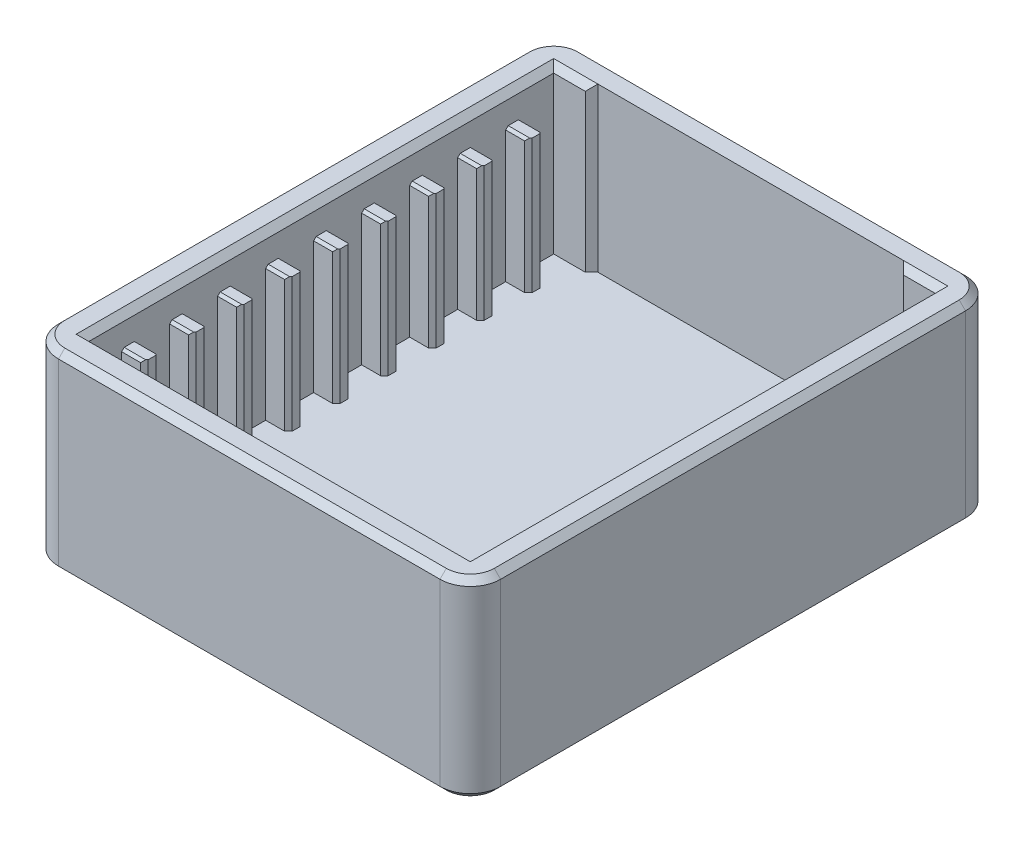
from build123d import *

# Parameters (mm, degrees)
BOSS_EXTRUDE1_DEPTH = 4.6
BOSS_EXTRUDE2_START = 4.6
BOSS_EXTRUDE2_DEPTH = 25.8
SKETCH1_5_W         = 3.6
SKETCH1_5_H         = 2.4
BOSS_EXTRUDE3_DEPTH = 25.8
CHAMFER1_SIZE       = 0.6
CHAMFER4_SIZE       = 0.4
CHAMFER6_SIZE       = 1
CUT_EXTRUDE2_DEPTH  = 25.8


with BuildPart() as part:
    # Sketch1 → Boss-Extrude1 (new body)
    with BuildSketch(Plane(origin=(0, 0, 0), x_dir=(1, 0, 0), z_dir=(0, 1, 0))):
        with BuildLine():
            Line((35, 78.4), (35, 83.2))
            Line((35, 83.2), (4.8, 83.2))
            ThreePointArc((4.8, 83.2), (1.40588745, 81.79411255), (0, 78.4))
            Line((0, 78.4), (0, 4.8))
            ThreePointArc((0, 4.8), (1.40588745, 1.40588745), (4.8, 0))
            Line((4.8, 0), (35, 0))
            Line((35, 0), (35, 4.8))
            Line((35, 4.8), (4.8, 4.8))
            Line((4.8, 4.8), (4.8, 10))
            Line((4.8, 10), (4.8, 12.4))
            Line((4.8, 12.4), (4.8, 17.6))
            Line((4.8, 17.6), (4.8, 20))
            Line((4.8, 20), (4.8, 25.2))
            Line((4.8, 25.2), (4.8, 27.6))
            Line((4.8, 27.6), (4.8, 32.8))
            Line((4.8, 32.8), (4.8, 35.2))
            Line((4.8, 35.2), (4.8, 40.4))
            Line((4.8, 40.4), (4.8, 42.8))
            Line((4.8, 42.8), (4.8, 48))
            Line((4.8, 48), (4.8, 50.4))
            Line((4.8, 50.4), (4.8, 55.6))
            Line((4.8, 55.6), (4.8, 58))
            Line((4.8, 58), (4.8, 63.2))
            Line((4.8, 63.2), (4.8, 65.6))
            Line((4.8, 65.6), (4.8, 70.8))
            Line((4.8, 70.8), (4.8, 73.2))
            Line((4.8, 73.2), (4.8, 78.4))
            Line((4.8, 78.4), (35, 78.4))
        make_face()
        Polygon((35, 4.8), (35, 78.4), (4.8, 78.4), (4.8, 73.2), (8.4, 73.2), (8.4, 70.8), (4.8, 70.8), (4.8, 65.6), (8.4, 65.6), (8.4, 63.2), (4.8, 63.2), (4.8, 58), (8.4, 58), (8.4, 55.6), (4.8, 55.6), (4.8, 50.4), (8.4, 50.4), (8.4, 48), (4.8, 48), (4.8, 42.8), (8.4, 42.8), (8.4, 40.4), (4.8, 40.4), (4.8, 35.2), (8.4, 35.2), (8.4, 32.8), (4.8, 32.8), (4.8, 27.6), (8.4, 27.6), (8.4, 25.2), (4.8, 25.2), (4.8, 20), (8.4, 20), (8.4, 17.6), (4.8, 17.6), (4.8, 12.4), (8.4, 12.4), (8.4, 10), (4.8, 10), (4.8, 4.8), align=None)
    extrude(amount=BOSS_EXTRUDE1_DEPTH)

    # Sketch1_3 → Boss-Extrude2 (add)
    with BuildSketch(Plane(origin=(0, 0, 0), x_dir=(1, 0, 0), z_dir=(0, 1, 0)).offset(BOSS_EXTRUDE2_START)):
        with BuildLine():
            Line((35, 78.4), (35, 83.2))
            Line((35, 83.2), (4.8, 83.2))
            ThreePointArc((4.8, 83.2), (1.40588745, 81.79411255), (0, 78.4))
            Line((0, 78.4), (0, 4.8))
            ThreePointArc((0, 4.8), (1.40588745, 1.40588745), (4.8, 0))
            Line((4.8, 0), (35, 0))
            Line((35, 0), (35, 4.8))
            Line((35, 4.8), (4.8, 4.8))
            Line((4.8, 4.8), (4.8, 10))
            Line((4.8, 10), (4.8, 12.4))
            Line((4.8, 12.4), (4.8, 17.6))
            Line((4.8, 17.6), (4.8, 20))
            Line((4.8, 20), (4.8, 25.2))
            Line((4.8, 25.2), (4.8, 27.6))
            Line((4.8, 27.6), (4.8, 32.8))
            Line((4.8, 32.8), (4.8, 35.2))
            Line((4.8, 35.2), (4.8, 40.4))
            Line((4.8, 40.4), (4.8, 42.8))
            Line((4.8, 42.8), (4.8, 48))
            Line((4.8, 48), (4.8, 50.4))
            Line((4.8, 50.4), (4.8, 55.6))
            Line((4.8, 55.6), (4.8, 58))
            Line((4.8, 58), (4.8, 63.2))
            Line((4.8, 63.2), (4.8, 65.6))
            Line((4.8, 65.6), (4.8, 70.8))
            Line((4.8, 70.8), (4.8, 73.2))
            Line((4.8, 73.2), (4.8, 78.4))
            Line((4.8, 78.4), (35, 78.4))
        make_face()
    extrude(amount=BOSS_EXTRUDE2_DEPTH)

    # Sketch1_5 → Boss-Extrude3 (add)
    with BuildSketch(Plane(origin=(0, 0, 0), x_dir=(1, 0, 0), z_dir=(0, 1, 0))):
        with Locations((6.6, 72)):
            Rectangle(SKETCH1_5_W, SKETCH1_5_H)
        with Locations((6.6, 11.2)):
            Rectangle(SKETCH1_5_W, SKETCH1_5_H)
        with Locations((6.6, 64.4)):
            Rectangle(SKETCH1_5_W, SKETCH1_5_H)
        with Locations((6.6, 18.8)):
            Rectangle(SKETCH1_5_W, SKETCH1_5_H)
        with Locations((6.6, 56.8)):
            Rectangle(SKETCH1_5_W, SKETCH1_5_H)
        with Locations((6.6, 26.4)):
            Rectangle(SKETCH1_5_W, SKETCH1_5_H)
        with Locations((6.6, 49.2)):
            Rectangle(SKETCH1_5_W, SKETCH1_5_H)
        with Locations((6.6, 34)):
            Rectangle(SKETCH1_5_W, SKETCH1_5_H)
        with Locations((6.6, 41.6)):
            Rectangle(SKETCH1_5_W, SKETCH1_5_H)
    extrude(amount=BOSS_EXTRUDE3_DEPTH)

    # Mirror2: part across plane


with BuildPart() as part_1:
    add(part.part)
    add(part.part.mirror(Plane(origin=(35, 4.6, 0), x_dir=(0, 0, 1), z_dir=(1, 0, 0))))

    # Chamfer1
    chamfer1_edges = [part_1.edges().sort_by_distance(p)[0] for p in [
        (8.4, 15.2, -10),
        (8.4, 15.2, -12.4),
        (8.4, 15.2, -17.6),
        (8.4, 15.2, -20),
        (8.4, 15.2, -25.2),
        (8.4, 15.2, -27.6),
        (8.4, 15.2, -32.8),
        (8.4, 15.2, -35.2),
        (8.4, 15.2, -40.4),
        (8.4, 15.2, -42.8),
        (8.4, 15.2, -48),
        (8.4, 15.2, -50.4),
        (8.4, 15.2, -55.6),
        (8.4, 15.2, -58),
        (8.4, 15.2, -63.2),
        (8.4, 15.2, -65.6),
        (8.4, 15.2, -70.8),
        (8.4, 15.2, -73.2),
        (61.6, 15.2, -10),
        (61.6, 15.2, -12.4),
        (61.6, 15.2, -17.6),
        (61.6, 15.2, -20),
        (61.6, 15.2, -25.2),
        (61.6, 15.2, -27.6),
        (61.6, 15.2, -32.8),
        (61.6, 15.2, -35.2),
        (61.6, 15.2, -40.4),
        (61.6, 15.2, -42.8),
        (61.6, 15.2, -48),
        (61.6, 15.2, -50.4),
        (61.6, 15.2, -55.6),
        (61.6, 15.2, -58),
        (61.6, 15.2, -63.2),
        (61.6, 15.2, -65.6),
        (61.6, 15.2, -70.8),
        (61.6, 15.2, -73.2),
    ]]
    chamfer(chamfer1_edges, length=CHAMFER1_SIZE)

    # Chamfer4
    chamfer4_edges = [part_1.edges().sort_by_distance(p)[0] for p in [
        (6.3, 25.8, -12.4),
        (6.3, 25.8, -10),
        (6.3, 25.8, -20),
        (6.3, 25.8, -17.6),
        (6.3, 25.8, -27.6),
        (6.3, 25.8, -25.2),
        (6.3, 25.8, -35.2),
        (6.3, 25.8, -32.8),
        (6.3, 25.8, -42.8),
        (6.3, 25.8, -40.4),
        (6.3, 25.8, -50.4),
        (6.3, 25.8, -48),
        (6.3, 25.8, -58),
        (6.3, 25.8, -55.6),
        (6.3, 25.8, -65.6),
        (6.3, 25.8, -63.2),
        (6.3, 25.8, -73.2),
        (6.3, 25.8, -70.8),
        (63.7, 25.8, -10),
        (63.7, 25.8, -12.4),
        (63.7, 25.8, -17.6),
        (63.7, 25.8, -20),
        (63.7, 25.8, -25.2),
        (63.7, 25.8, -27.6),
        (63.7, 25.8, -32.8),
        (63.7, 25.8, -35.2),
        (63.7, 25.8, -40.4),
        (63.7, 25.8, -42.8),
        (63.7, 25.8, -48),
        (63.7, 25.8, -50.4),
        (63.7, 25.8, -55.6),
        (63.7, 25.8, -58),
        (63.7, 25.8, -63.2),
        (63.7, 25.8, -65.6),
        (63.7, 25.8, -70.8),
        (63.7, 25.8, -73.2),
    ]]
    chamfer(chamfer4_edges, length=CHAMFER4_SIZE)

    # Chamfer6
    chamfer6_edges = [part_1.edges().sort_by_distance(p)[0] for p in [
        (35, 30.4, -83.2),
        (0, 30.4, -41.6),
        (35, 30.4, -4.8),
        (4.8, 30.4, -41.6),
        (1.40588745, 30.4, -81.79411255),
        (1.40588745, 30.4, -1.40588745),
        (35, 30.4, 0),
        (35, 30.4, -78.4),
        (68.59411255, 30.4, -81.79411255),
        (70, 0, -41.6),
        (68.59411255, 30.4, -1.40588745),
        (68.59411255, 0, -81.79411255),
        (68.59411255, 0, -1.40588745),
        (65.2, 30.4, -41.6),
        (70, 30.4, -41.6),
        (35, 0, 0),
        (1.40588745, 0, -1.40588745),
        (0, 0, -41.6),
        (1.40588745, 0, -81.79411255),
        (35, 0, -83.2),
    ]]
    chamfer(chamfer6_edges, length=CHAMFER6_SIZE)

    # Sketch5 → Cut-Extrude2 (cut)
    with BuildSketch(Plane(origin=(0, 30.4, 0), x_dir=(1, 0, 0), z_dir=(0, 1, 0))):
        Polygon((9.8, 78.4), (10.8, 79.4), (59.2, 79.4), (60.2, 78.4), align=None)
        Polygon((9.8, 4.8), (10.8, 3.8), (59.2, 3.8), (60.2, 4.8), align=None)
    extrude(amount=-CUT_EXTRUDE2_DEPTH, mode=Mode.SUBTRACT)


solid = part_1.part
